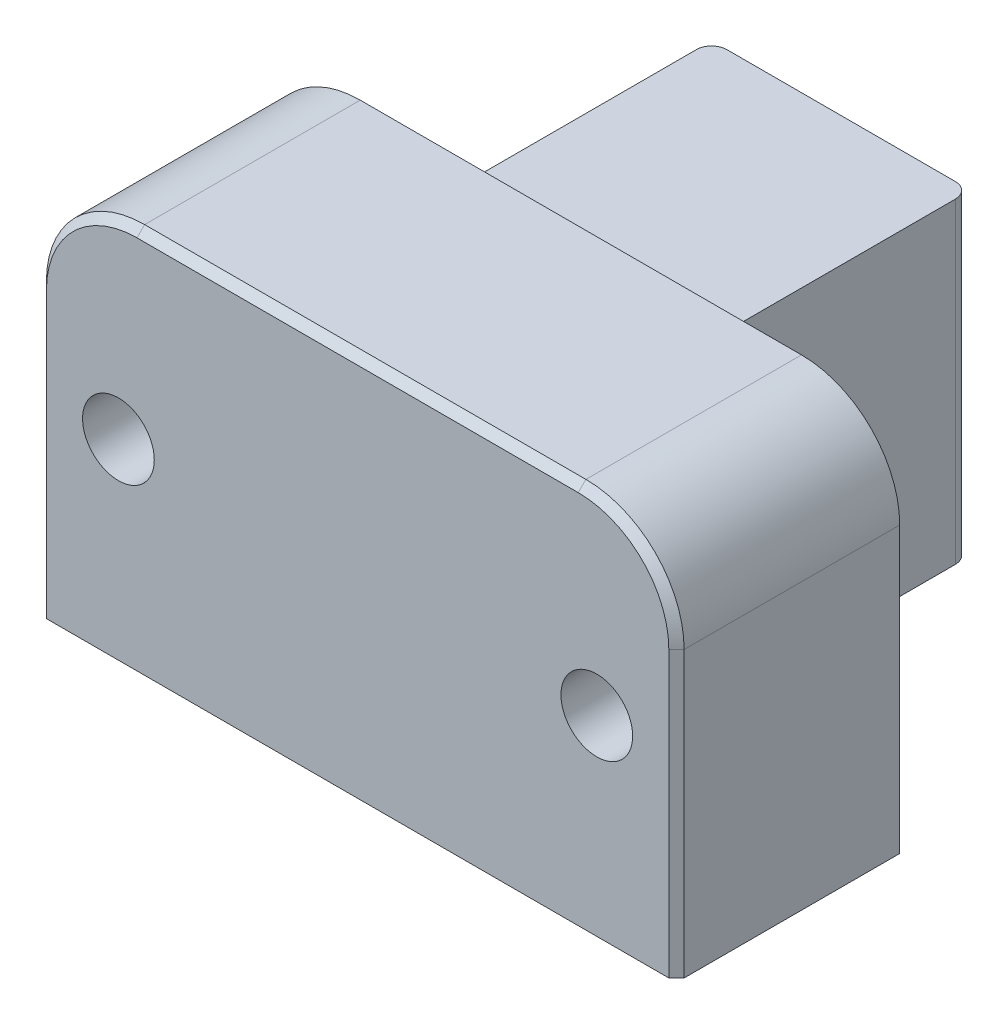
from build123d import *

# Parameters (mm, degrees)
EXTRUDE1_DEPTH     = 38.1
SKETCH3_W          = 50.8
SKETCH3_H          = 8.63099273
SKETCH3_H_2        = 7.62
CUT_EXTRUDE2_DEPTH = 25.4
FILLET2_R          = 1.524
FILLET3_R          = 0.7874
FILLET4_R          = 9.779
CHAMFER1_SIZE      = 0.762


with BuildPart() as part:
    # Sketch1 → Extrude1 (new body)
    with BuildSketch(Plane(origin=(0, 0, 0), x_dir=(1, 0, 0), z_dir=(0, 1, 0))):
        Polygon((-31.74365, 0), (-12.8905, 0), (-12.8905, 25.908), (12.8905, 25.908), (12.8905, 0), (31.74365, 0), (31.74365, -22.225), (-31.74365, -22.225), align=None)
    extrude(amount=EXTRUDE1_DEPTH)

    # Sketch3 → Cut-Extrude2 (cut, symmetric)
    with BuildSketch(Plane(origin=(0, 0, 0), x_dir=(0, 0, -1), z_dir=(1, 0, 0))):
        with Locations((25.4, -1.013496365)):
            Rectangle(SKETCH3_W, SKETCH3_H)
        with Locations((25.4, 38.608)):
            Rectangle(SKETCH3_W, SKETCH3_H_2)
    extrude(amount=CUT_EXTRUDE2_DEPTH, both=True, mode=Mode.SUBTRACT)

    # Fillet2
    fillet2_edges = [part.edges().sort_by_distance(p)[0] for p in [
        (-12.8905, 19.05, -25.908),
        (12.8905, 19.05, -25.908),
    ]]
    fillet(fillet2_edges, radius=FILLET2_R)

    # Fillet3
    fillet3_edges = [part.edges().sort_by_distance(p)[0] for p in [
        (12.8905, 19.05, 0),
        (-12.8905, 19.05, 0),
    ]]
    fillet(fillet3_edges, radius=FILLET3_R)

    # Fillet4
    fillet4_edges = [part.edges().sort_by_distance(p)[0] for p in [
        (31.74365, 38.1, 11.1125),
        (-31.74365, 38.1, 11.1125),
    ]]
    fillet(fillet4_edges, radius=FILLET4_R)

    # Sketch4 → Cut-Revolve1 (revolve, cut)
    with BuildSketch(Plane(origin=(0, 19.05, 0), x_dir=(-1, 0, 0), z_dir=(0, 1, 0))):
        Polygon((23.8125, 22.225), (20.2438, 22.225), (20.2438, 6.7564), (18.6563, 6.7564), (18.6563, 0), (23.8125, 0), align=None)
    cut_revolve1 = revolve(axis=Axis((-23.8125, 19.05, 26.865158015), (0, 0, -1)), mode=Mode.SUBTRACT)

    # Mirror1: Cut-Revolve1 across plane
    add(cut_revolve1.mirror(Plane(origin=(0, 0, 0), x_dir=(0, 0, 1), z_dir=(1, 0, 0))), mode=Mode.SUBTRACT)

    # Chamfer1
    chamfer1_edges = [part.edges().sort_by_distance(p)[0] for p in [
        (31.74365, 14.1605, 22.225),
        (-31.74365, 14.1605, 22.225),
        (-28.879447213, 35.235797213, 22.225),
        (28.879447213, 35.235797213, 22.225),
        (0, 38.1, 22.225),
    ]]
    chamfer(chamfer1_edges, length=CHAMFER1_SIZE)


solid = part.part
